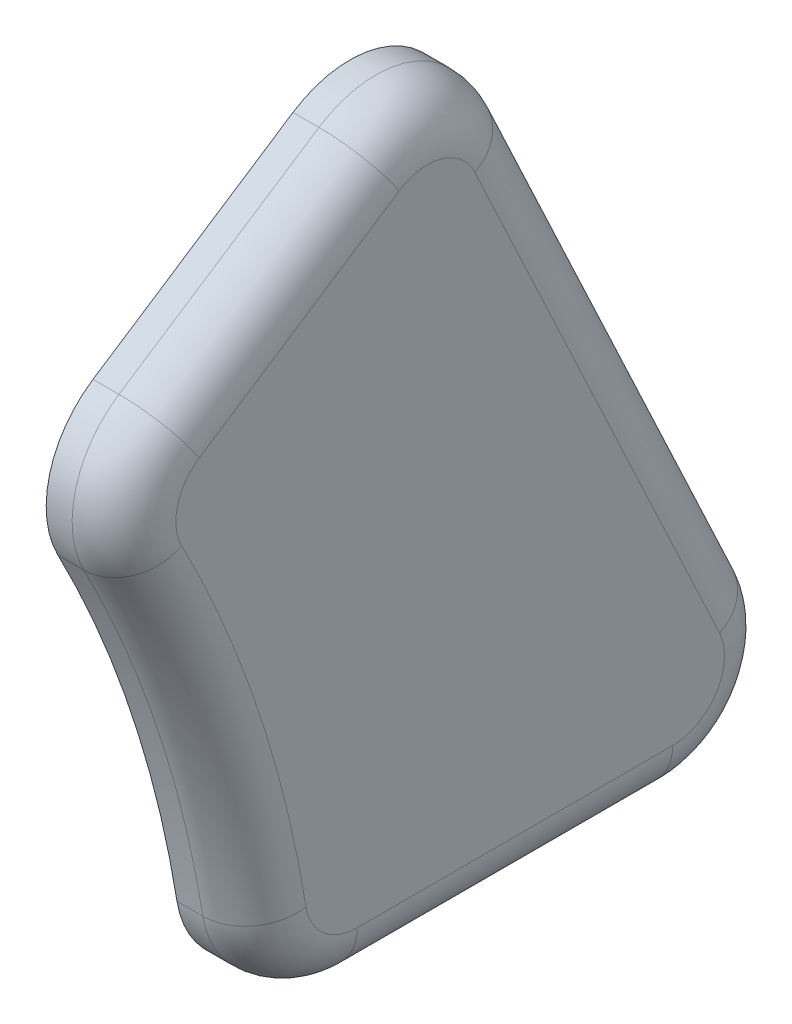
from build123d import *

# Parameters (mm, degrees)
SALIENTE_EXTRUIR1_DEPTH = 15
REDONDEO1_R             = 10


with BuildPart() as part:
    # Croquis1 → Saliente-Extruir1 (new body)
    with BuildSketch(Plane(origin=(0, 0, 0), x_dir=(0, 0, -1), z_dir=(1, 0, 0))):
        with BuildLine():
            Line((12994.164118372, 4904.59832959), (13041.39353255, 4803.986902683))
            ThreePointArc((13041.39353255, 4803.986902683), (13040.170597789, 4784.763802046), (13023.28904578, 4775.488222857))
            Line((13023.28904578, 4775.488222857), (12962.46593595, 4775.488222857))
            ThreePointArc((12962.46593595, 4775.488222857), (12949.504454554, 4780.256676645), (12942.723595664, 4792.288222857))
            ThreePointArc((12942.723595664, 4792.288222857), (12934.007452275, 4827.848719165), (12919.758920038, 4861.575553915))
            ThreePointArc((12919.758920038, 4861.575553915), (12918.152803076, 4875.852106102), (12926.532053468, 4887.522055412))
            Line((12926.532053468, 4887.522055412), (12965.08735306, 4912.821165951))
            ThreePointArc((12965.08735306, 4912.821165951), (12981.502136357, 4915.344886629), (12994.164118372, 4904.59832959))
        make_face()
    extrude(amount=SALIENTE_EXTRUIR1_DEPTH)

    # Redondeo1
    redondeo1_edges = [part.edges().sort_by_distance(p)[0] for p in [
        (15, 4875.852106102, -12918.152803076),
        (15, 4827.848719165, -12934.007452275),
        (15, 4780.256676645, -12949.504454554),
        (15, 4775.488222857, -12992.877490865),
        (15, 4784.763802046, -13040.170597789),
        (15, 4854.292616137, -13017.778825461),
        (15, 4915.344886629, -12981.502136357),
        (15, 4900.171610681, -12945.809703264),
    ]]
    fillet(redondeo1_edges, radius=REDONDEO1_R)


solid = part.part
